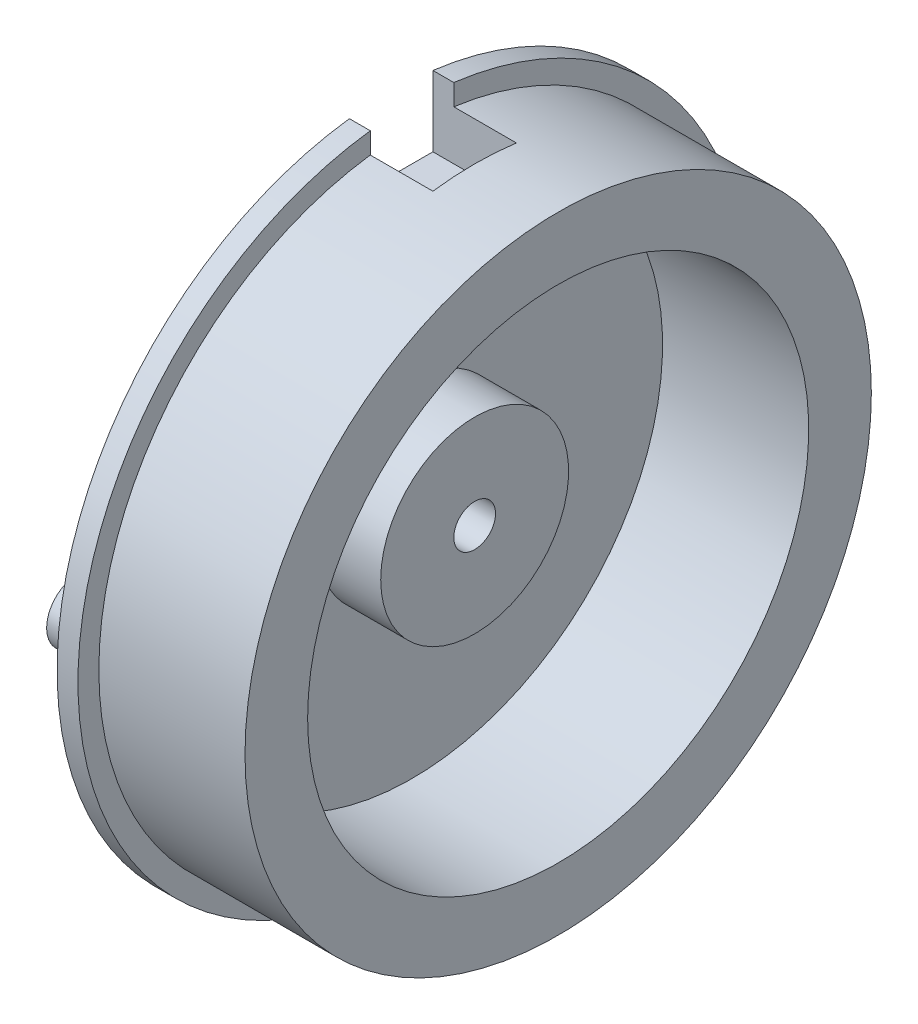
ISO-10303-21;
HEADER;
FILE_DESCRIPTION(('STEP AP214'),'2;1');
FILE_NAME('part.step','',(''),(''),'','','');
FILE_SCHEMA(('AUTOMOTIVE_DESIGN { 1 0 10303 214 1 1 1 1 }'));
ENDSEC;
DATA;
#1=APPLICATION_CONTEXT('core data for automotive mechanical design processes');
#2=APPLICATION_PROTOCOL_DEFINITION('international standard','automotive_design',2000,#1);
#3=PRODUCT_CONTEXT('',#1,'mechanical');
#4=PRODUCT('Part','Part','',(#3));
#5=PRODUCT_RELATED_PRODUCT_CATEGORY('part','',(#4));
#6=PRODUCT_DEFINITION_FORMATION('','',#4);
#7=PRODUCT_DEFINITION_CONTEXT('part definition',#1,'design');
#8=PRODUCT_DEFINITION('design','',#6,#7);
#9=PRODUCT_DEFINITION_SHAPE('','',#8);
#10=(LENGTH_UNIT() NAMED_UNIT(*) SI_UNIT(.MILLI.,.METRE.));
#11=(NAMED_UNIT(*) PLANE_ANGLE_UNIT() SI_UNIT($,.RADIAN.));
#12=(NAMED_UNIT(*) SI_UNIT($,.STERADIAN.) SOLID_ANGLE_UNIT());
#13=UNCERTAINTY_MEASURE_WITH_UNIT(LENGTH_MEASURE(1.E-05),#10,'distance_accuracy_value','');
#14=(GEOMETRIC_REPRESENTATION_CONTEXT(3) GLOBAL_UNCERTAINTY_ASSIGNED_CONTEXT((#13)) GLOBAL_UNIT_ASSIGNED_CONTEXT((#10,
#11,#12)) REPRESENTATION_CONTEXT('',''));
#15=CARTESIAN_POINT('',(0.,0.,0.));
#16=DIRECTION('',(0.,0.,1.));
#17=DIRECTION('',(1.,0.,0.));
#18=AXIS2_PLACEMENT_3D('',#15,#16,#17);
#19=CARTESIAN_POINT('',(0.,4.5,0.));
#20=DIRECTION('',(1.,0.,0.));
#21=DIRECTION('',(0.,0.,-1.));
#22=AXIS2_PLACEMENT_3D('',#19,#20,#21);
#23=PLANE('',#22);
#24=CARTESIAN_POINT('',(0.,0.,13.));
#25=DIRECTION('',(1.,0.,0.));
#26=DIRECTION('',(0.,0.,-1.));
#27=AXIS2_PLACEMENT_3D('',#24,#25,#26);
#28=CIRCLE('',#27,0.999999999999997);
#29=CARTESIAN_POINT('',(0.,0.,12.));
#30=VERTEX_POINT('',#29);
#31=EDGE_CURVE('E35',#30,#30,#28,.F.);
#32=ORIENTED_EDGE('',*,*,#31,.F.);
#33=EDGE_LOOP('',(#32));
#34=FACE_BOUND('',#33,.T.);
#35=DIRECTION('',(0.,0.,-1.));
#36=VECTOR('',#35,1.);
#37=CARTESIAN_POINT('',(0.,-12.5,1.99999999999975));
#38=LINE('',#37,#36);
#39=CARTESIAN_POINT('',(0.,-12.5,1.99999999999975));
#40=VERTEX_POINT('',#39);
#41=CARTESIAN_POINT('',(0.,-12.5,-2.00000000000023));
#42=VERTEX_POINT('',#41);
#43=EDGE_CURVE('E42',#40,#42,#38,.T.);
#44=ORIENTED_EDGE('',*,*,#43,.F.);
#45=DIRECTION('',(0.,1.,0.));
#46=VECTOR('',#45,1.);
#47=CARTESIAN_POINT('',(0.,-15.8745078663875,1.99999999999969));
#48=LINE('',#47,#46);
#49=CARTESIAN_POINT('',(0.,-15.8745078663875,1.99999999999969));
#50=VERTEX_POINT('',#49);
#51=EDGE_CURVE('E124',#50,#40,#48,.T.);
#52=ORIENTED_EDGE('',*,*,#51,.F.);
#53=CARTESIAN_POINT('',(0.,0.,0.));
#54=DIRECTION('',(-1.,0.,0.));
#55=DIRECTION('',(0.,0.,1.));
#56=AXIS2_PLACEMENT_3D('',#53,#54,#55);
#57=CIRCLE('',#56,15.9999999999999);
#58=CARTESIAN_POINT('',(0.,15.8745078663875,1.99999999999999));
#59=VERTEX_POINT('',#58);
#60=EDGE_CURVE('E140',#50,#59,#57,.T.);
#61=ORIENTED_EDGE('',*,*,#60,.T.);
#62=DIRECTION('',(0.,1.,0.));
#63=VECTOR('',#62,1.);
#64=CARTESIAN_POINT('',(0.,12.5,1.99999999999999));
#65=LINE('',#64,#63);
#66=CARTESIAN_POINT('',(0.,12.5,1.99999999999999));
#67=VERTEX_POINT('',#66);
#68=EDGE_CURVE('E264',#67,#59,#65,.T.);
#69=ORIENTED_EDGE('',*,*,#68,.F.);
#70=DIRECTION('',(0.,0.,1.));
#71=VECTOR('',#70,1.);
#72=CARTESIAN_POINT('',(0.,12.5,-1.99999999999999));
#73=LINE('',#72,#71);
#74=CARTESIAN_POINT('',(0.,12.5,-1.99999999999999));
#75=VERTEX_POINT('',#74);
#76=EDGE_CURVE('E50',#75,#67,#73,.T.);
#77=ORIENTED_EDGE('',*,*,#76,.F.);
#78=DIRECTION('',(0.,-1.,0.));
#79=VECTOR('',#78,1.);
#80=CARTESIAN_POINT('',(0.,15.8745078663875,-1.99999999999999));
#81=LINE('',#80,#79);
#82=CARTESIAN_POINT('',(0.,15.8745078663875,-1.99999999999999));
#83=VERTEX_POINT('',#82);
#84=EDGE_CURVE('E138',#83,#75,#81,.T.);
#85=ORIENTED_EDGE('',*,*,#84,.F.);
#86=CARTESIAN_POINT('',(0.,-15.8745078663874,-2.00000000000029));
#87=VERTEX_POINT('',#86);
#88=EDGE_CURVE('E130',#83,#87,#57,.T.);
#89=ORIENTED_EDGE('',*,*,#88,.T.);
#90=DIRECTION('',(0.,-1.,0.));
#91=VECTOR('',#90,1.);
#92=CARTESIAN_POINT('',(0.,-12.5,-2.00000000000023));
#93=LINE('',#92,#91);
#94=EDGE_CURVE('E115',#42,#87,#93,.T.);
#95=ORIENTED_EDGE('',*,*,#94,.F.);
#96=EDGE_LOOP('',(#44,#52,#61,#69,#77,#85,#89,#95));
#97=FACE_BOUND('',#96,.T.);
#98=CARTESIAN_POINT('',(0.,0.,0.));
#99=DIRECTION('',(-1.,0.,0.));
#100=DIRECTION('',(0.,0.,1.));
#101=AXIS2_PLACEMENT_3D('',#98,#99,#100);
#102=CIRCLE('',#101,4.5);
#103=CARTESIAN_POINT('',(0.,0.,4.5));
#104=VERTEX_POINT('',#103);
#105=EDGE_CURVE('E139',#104,#104,#102,.T.);
#106=ORIENTED_EDGE('',*,*,#105,.F.);
#107=EDGE_LOOP('',(#106));
#108=FACE_BOUND('',#107,.T.);
#109=CARTESIAN_POINT('',(0.,11.2583302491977,-6.50000000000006));
#110=DIRECTION('',(1.,0.,0.));
#111=DIRECTION('',(0.,0.,-1.));
#112=AXIS2_PLACEMENT_3D('',#109,#110,#111);
#113=CIRCLE('',#112,0.999999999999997);
#114=CARTESIAN_POINT('',(0.,11.2583302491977,-7.50000000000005));
#115=VERTEX_POINT('',#114);
#116=EDGE_CURVE('E182',#115,#115,#113,.F.);
#117=ORIENTED_EDGE('',*,*,#116,.F.);
#118=EDGE_LOOP('',(#117));
#119=FACE_BOUND('',#118,.T.);
#120=CARTESIAN_POINT('',(0.,-11.2583302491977,-6.50000000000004));
#121=DIRECTION('',(1.,0.,0.));
#122=DIRECTION('',(0.,0.,-1.));
#123=AXIS2_PLACEMENT_3D('',#120,#121,#122);
#124=CIRCLE('',#123,0.999999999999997);
#125=CARTESIAN_POINT('',(0.,-11.2583302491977,-7.50000000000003));
#126=VERTEX_POINT('',#125);
#127=EDGE_CURVE('E11',#126,#126,#124,.F.);
#128=ORIENTED_EDGE('',*,*,#127,.F.);
#129=EDGE_LOOP('',(#128));
#130=FACE_BOUND('',#129,.T.);
#131=ADVANCED_FACE('F27',(#34,#97,#108,#119,#130),#23,.F.);
#132=CARTESIAN_POINT('',(0.,0.,0.));
#133=DIRECTION('',(-1.,0.,0.));
#134=DIRECTION('',(0.,0.,1.));
#135=AXIS2_PLACEMENT_3D('',#132,#133,#134);
#136=CYLINDRICAL_SURFACE('',#135,15.9999999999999);
#137=ORIENTED_EDGE('',*,*,#60,.F.);
#138=DIRECTION('',(-1.,0.,0.));
#139=VECTOR('',#138,1.);
#140=CARTESIAN_POINT('',(4.,-15.8745078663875,1.99999999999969));
#141=LINE('',#140,#139);
#142=CARTESIAN_POINT('',(0.999999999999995,-15.8745078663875,1.99999999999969));
#143=VERTEX_POINT('',#142);
#144=EDGE_CURVE('E133',#143,#50,#141,.T.);
#145=ORIENTED_EDGE('',*,*,#144,.F.);
#146=CARTESIAN_POINT('',(0.999999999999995,0.,0.));
#147=DIRECTION('',(-1.,0.,0.));
#148=DIRECTION('',(0.,0.,1.));
#149=AXIS2_PLACEMENT_3D('',#146,#147,#148);
#150=CIRCLE('',#149,15.9999999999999);
#151=CARTESIAN_POINT('',(0.999999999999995,15.8745078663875,1.99999999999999));
#152=VERTEX_POINT('',#151);
#153=EDGE_CURVE('E176',#143,#152,#150,.T.);
#154=ORIENTED_EDGE('',*,*,#153,.T.);
#155=DIRECTION('',(-1.,0.,0.));
#156=VECTOR('',#155,1.);
#157=CARTESIAN_POINT('',(4.,15.8745078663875,1.99999999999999));
#158=LINE('',#157,#156);
#159=EDGE_CURVE('E258',#152,#59,#158,.T.);
#160=ORIENTED_EDGE('',*,*,#159,.T.);
#161=EDGE_LOOP('',(#137,#145,#154,#160));
#162=FACE_BOUND('',#161,.T.);
#163=ADVANCED_FACE('F190',(#162),#136,.T.);
#164=CARTESIAN_POINT('',(0.999999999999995,15.9999999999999,0.));
#165=DIRECTION('',(-1.,0.,0.));
#166=DIRECTION('',(0.,0.,1.));
#167=AXIS2_PLACEMENT_3D('',#164,#165,#166);
#168=PLANE('',#167);
#169=ORIENTED_EDGE('',*,*,#153,.F.);
#170=DIRECTION('',(0.,1.,0.));
#171=VECTOR('',#170,1.);
#172=CARTESIAN_POINT('',(0.999999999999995,15.9999999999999,2.00000000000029));
#173=LINE('',#172,#171);
#174=CARTESIAN_POINT('',(0.999999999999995,-14.8660687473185,1.99999999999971));
#175=VERTEX_POINT('',#174);
#176=EDGE_CURVE('E250',#143,#175,#173,.T.);
#177=ORIENTED_EDGE('',*,*,#176,.T.);
#178=CARTESIAN_POINT('',(0.999999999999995,0.,0.));
#179=DIRECTION('',(-1.,0.,0.));
#180=DIRECTION('',(0.,0.,1.));
#181=AXIS2_PLACEMENT_3D('',#178,#179,#180);
#182=CIRCLE('',#181,14.9999999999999);
#183=CARTESIAN_POINT('',(0.999999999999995,14.8660687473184,1.99999999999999));
#184=VERTEX_POINT('',#183);
#185=EDGE_CURVE('E172',#175,#184,#182,.T.);
#186=ORIENTED_EDGE('',*,*,#185,.T.);
#187=DIRECTION('',(0.,1.,0.));
#188=VECTOR('',#187,1.);
#189=CARTESIAN_POINT('',(0.999999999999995,15.9999999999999,1.99999999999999));
#190=LINE('',#189,#188);
#191=EDGE_CURVE('E253',#184,#152,#190,.T.);
#192=ORIENTED_EDGE('',*,*,#191,.T.);
#193=EDGE_LOOP('',(#169,#177,#186,#192));
#194=FACE_BOUND('',#193,.T.);
#195=ADVANCED_FACE('F195',(#194),#168,.F.);
#196=CARTESIAN_POINT('',(0.999999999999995,15.8745078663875,-1.99999999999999));
#197=VERTEX_POINT('',#196);
#198=CARTESIAN_POINT('',(0.999999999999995,-15.8745078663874,-2.00000000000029));
#199=VERTEX_POINT('',#198);
#200=EDGE_CURVE('E132',#197,#199,#150,.T.);
#201=ORIENTED_EDGE('',*,*,#200,.T.);
#202=DIRECTION('',(-1.,0.,0.));
#203=VECTOR('',#202,1.);
#204=CARTESIAN_POINT('',(4.,-15.8745078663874,-2.00000000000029));
#205=LINE('',#204,#203);
#206=EDGE_CURVE('E118',#199,#87,#205,.T.);
#207=ORIENTED_EDGE('',*,*,#206,.T.);
#208=ORIENTED_EDGE('',*,*,#88,.F.);
#209=DIRECTION('',(-1.,0.,0.));
#210=VECTOR('',#209,1.);
#211=CARTESIAN_POINT('',(4.,15.8745078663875,-1.99999999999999));
#212=LINE('',#211,#210);
#213=EDGE_CURVE('E265',#197,#83,#212,.T.);
#214=ORIENTED_EDGE('',*,*,#213,.F.);
#215=EDGE_LOOP('',(#201,#207,#208,#214));
#216=FACE_BOUND('',#215,.T.);
#217=ADVANCED_FACE('F29',(#216),#136,.T.);
#218=CARTESIAN_POINT('',(0.999999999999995,14.8660687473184,-1.99999999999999));
#219=VERTEX_POINT('',#218);
#220=CARTESIAN_POINT('',(0.999999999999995,-14.8660687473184,-2.00000000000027));
#221=VERTEX_POINT('',#220);
#222=EDGE_CURVE('E173',#219,#221,#182,.T.);
#223=ORIENTED_EDGE('',*,*,#222,.T.);
#224=DIRECTION('',(0.,-1.,0.));
#225=VECTOR('',#224,1.);
#226=CARTESIAN_POINT('',(0.999999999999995,16.,-1.99999999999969));
#227=LINE('',#226,#225);
#228=EDGE_CURVE('E288',#221,#199,#227,.T.);
#229=ORIENTED_EDGE('',*,*,#228,.T.);
#230=ORIENTED_EDGE('',*,*,#200,.F.);
#231=DIRECTION('',(0.,-1.,0.));
#232=VECTOR('',#231,1.);
#233=CARTESIAN_POINT('',(0.999999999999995,15.9999999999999,-1.99999999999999));
#234=LINE('',#233,#232);
#235=EDGE_CURVE('E145',#197,#219,#234,.T.);
#236=ORIENTED_EDGE('',*,*,#235,.T.);
#237=EDGE_LOOP('',(#223,#229,#230,#236));
#238=FACE_BOUND('',#237,.T.);
#239=ADVANCED_FACE('F236',(#238),#168,.F.);
#240=CARTESIAN_POINT('',(0.,0.,0.));
#241=DIRECTION('',(-1.,0.,0.));
#242=DIRECTION('',(0.,0.,1.));
#243=AXIS2_PLACEMENT_3D('',#240,#241,#242);
#244=CYLINDRICAL_SURFACE('',#243,14.9999999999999);
#245=ORIENTED_EDGE('',*,*,#185,.F.);
#246=DIRECTION('',(-1.,0.,0.));
#247=VECTOR('',#246,1.);
#248=CARTESIAN_POINT('',(0.,-14.8660687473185,1.99999999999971));
#249=LINE('',#248,#247);
#250=CARTESIAN_POINT('',(4.,-14.8660687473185,1.99999999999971));
#251=VERTEX_POINT('',#250);
#252=EDGE_CURVE('E291',#175,#251,#249,.F.);
#253=ORIENTED_EDGE('',*,*,#252,.T.);
#254=CARTESIAN_POINT('',(4.,0.,0.));
#255=DIRECTION('',(-1.,0.,0.));
#256=DIRECTION('',(0.,0.,1.));
#257=AXIS2_PLACEMENT_3D('',#254,#255,#256);
#258=CIRCLE('',#257,14.9999999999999);
#259=CARTESIAN_POINT('',(4.,-14.8660687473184,-2.00000000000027));
#260=VERTEX_POINT('',#259);
#261=EDGE_CURVE('E180',#260,#251,#258,.T.);
#262=ORIENTED_EDGE('',*,*,#261,.F.);
#263=DIRECTION('',(-1.,0.,0.));
#264=VECTOR('',#263,1.);
#265=CARTESIAN_POINT('',(0.,-14.8660687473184,-2.00000000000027));
#266=LINE('',#265,#264);
#267=EDGE_CURVE('E285',#260,#221,#266,.T.);
#268=ORIENTED_EDGE('',*,*,#267,.T.);
#269=ORIENTED_EDGE('',*,*,#222,.F.);
#270=DIRECTION('',(-1.,0.,0.));
#271=VECTOR('',#270,1.);
#272=CARTESIAN_POINT('',(0.,14.8660687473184,-1.99999999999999));
#273=LINE('',#272,#271);
#274=CARTESIAN_POINT('',(4.,14.8660687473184,-1.99999999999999));
#275=VERTEX_POINT('',#274);
#276=EDGE_CURVE('E276',#219,#275,#273,.F.);
#277=ORIENTED_EDGE('',*,*,#276,.T.);
#278=CARTESIAN_POINT('',(4.,0.,0.));
#279=DIRECTION('',(-1.,0.,0.));
#280=DIRECTION('',(0.,0.,1.));
#281=AXIS2_PLACEMENT_3D('',#278,#279,#280);
#282=CIRCLE('',#281,14.9999999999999);
#283=CARTESIAN_POINT('',(4.,14.8660687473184,1.99999999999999));
#284=VERTEX_POINT('',#283);
#285=EDGE_CURVE('E178',#284,#275,#282,.T.);
#286=ORIENTED_EDGE('',*,*,#285,.F.);
#287=DIRECTION('',(-1.,0.,0.));
#288=VECTOR('',#287,1.);
#289=CARTESIAN_POINT('',(0.,14.8660687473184,1.99999999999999));
#290=LINE('',#289,#288);
#291=EDGE_CURVE('E274',#284,#184,#290,.T.);
#292=ORIENTED_EDGE('',*,*,#291,.T.);
#293=EDGE_LOOP('',(#245,#253,#262,#268,#269,#277,#286,#292));
#294=FACE_BOUND('',#293,.T.);
#295=CARTESIAN_POINT('',(7.99999999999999,0.,0.));
#296=DIRECTION('',(-1.,0.,0.));
#297=DIRECTION('',(0.,0.,1.));
#298=AXIS2_PLACEMENT_3D('',#295,#296,#297);
#299=CIRCLE('',#298,14.9999999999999);
#300=CARTESIAN_POINT('',(7.99999999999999,0.,14.9999999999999));
#301=VERTEX_POINT('',#300);
#302=EDGE_CURVE('E169',#301,#301,#299,.T.);
#303=ORIENTED_EDGE('',*,*,#302,.T.);
#304=EDGE_LOOP('',(#303));
#305=FACE_BOUND('',#304,.T.);
#306=ADVANCED_FACE('F233',(#294,#305),#244,.T.);
#307=CARTESIAN_POINT('',(7.99999999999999,14.9999999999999,0.));
#308=DIRECTION('',(-1.,0.,0.));
#309=DIRECTION('',(0.,0.,1.));
#310=AXIS2_PLACEMENT_3D('',#307,#308,#309);
#311=PLANE('',#310);
#312=ORIENTED_EDGE('',*,*,#302,.F.);
#313=EDGE_LOOP('',(#312));
#314=FACE_BOUND('',#313,.T.);
#315=CARTESIAN_POINT('',(7.99999999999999,0.,0.));
#316=DIRECTION('',(-1.,0.,0.));
#317=DIRECTION('',(0.,0.,1.));
#318=AXIS2_PLACEMENT_3D('',#315,#316,#317);
#319=CIRCLE('',#318,11.9999999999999);
#320=CARTESIAN_POINT('',(7.99999999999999,0.,11.9999999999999));
#321=VERTEX_POINT('',#320);
#322=EDGE_CURVE('E166',#321,#321,#319,.T.);
#323=ORIENTED_EDGE('',*,*,#322,.T.);
#324=EDGE_LOOP('',(#323));
#325=FACE_BOUND('',#324,.T.);
#326=ADVANCED_FACE('F229',(#314,#325),#311,.F.);
#327=CARTESIAN_POINT('',(0.,0.,0.));
#328=DIRECTION('',(-1.,0.,0.));
#329=DIRECTION('',(0.,0.,1.));
#330=AXIS2_PLACEMENT_3D('',#327,#328,#329);
#331=CYLINDRICAL_SURFACE('',#330,11.9999999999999);
#332=ORIENTED_EDGE('',*,*,#322,.F.);
#333=EDGE_LOOP('',(#332));
#334=FACE_BOUND('',#333,.T.);
#335=CARTESIAN_POINT('',(0.999999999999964,0.,0.));
#336=DIRECTION('',(-1.,0.,0.));
#337=DIRECTION('',(0.,0.,1.));
#338=AXIS2_PLACEMENT_3D('',#335,#336,#337);
#339=CIRCLE('',#338,11.9999999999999);
#340=CARTESIAN_POINT('',(0.999999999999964,0.,11.9999999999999));
#341=VERTEX_POINT('',#340);
#342=EDGE_CURVE('E163',#341,#341,#339,.T.);
#343=ORIENTED_EDGE('',*,*,#342,.T.);
#344=EDGE_LOOP('',(#343));
#345=FACE_BOUND('',#344,.T.);
#346=ADVANCED_FACE('F225',(#334,#345),#331,.F.);
#347=CARTESIAN_POINT('',(0.999999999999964,11.9999999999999,0.));
#348=DIRECTION('',(-1.,0.,0.));
#349=DIRECTION('',(0.,0.,1.));
#350=AXIS2_PLACEMENT_3D('',#347,#348,#349);
#351=PLANE('',#350);
#352=ORIENTED_EDGE('',*,*,#342,.F.);
#353=EDGE_LOOP('',(#352));
#354=FACE_BOUND('',#353,.T.);
#355=CARTESIAN_POINT('',(0.999999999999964,0.,0.));
#356=DIRECTION('',(-1.,0.,0.));
#357=DIRECTION('',(0.,0.,1.));
#358=AXIS2_PLACEMENT_3D('',#355,#356,#357);
#359=CIRCLE('',#358,4.5);
#360=CARTESIAN_POINT('',(0.999999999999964,0.,4.5));
#361=VERTEX_POINT('',#360);
#362=EDGE_CURVE('E160',#361,#361,#359,.T.);
#363=ORIENTED_EDGE('',*,*,#362,.T.);
#364=EDGE_LOOP('',(#363));
#365=FACE_BOUND('',#364,.T.);
#366=ADVANCED_FACE('F221',(#354,#365),#351,.F.);
#367=CARTESIAN_POINT('',(0.,0.,0.));
#368=DIRECTION('',(-1.,0.,0.));
#369=DIRECTION('',(0.,0.,1.));
#370=AXIS2_PLACEMENT_3D('',#367,#368,#369);
#371=CYLINDRICAL_SURFACE('',#370,4.5);
#372=ORIENTED_EDGE('',*,*,#362,.F.);
#373=EDGE_LOOP('',(#372));
#374=FACE_BOUND('',#373,.T.);
#375=CARTESIAN_POINT('',(3.99999999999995,0.,0.));
#376=DIRECTION('',(-1.,0.,0.));
#377=DIRECTION('',(0.,0.,1.));
#378=AXIS2_PLACEMENT_3D('',#375,#376,#377);
#379=CIRCLE('',#378,4.5);
#380=CARTESIAN_POINT('',(3.99999999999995,0.,4.5));
#381=VERTEX_POINT('',#380);
#382=EDGE_CURVE('E157',#381,#381,#379,.T.);
#383=ORIENTED_EDGE('',*,*,#382,.T.);
#384=EDGE_LOOP('',(#383));
#385=FACE_BOUND('',#384,.T.);
#386=ADVANCED_FACE('F217',(#374,#385),#371,.T.);
#387=CARTESIAN_POINT('',(3.99999999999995,4.5,0.));
#388=DIRECTION('',(-1.,0.,0.));
#389=DIRECTION('',(0.,0.,1.));
#390=AXIS2_PLACEMENT_3D('',#387,#388,#389);
#391=PLANE('',#390);
#392=ORIENTED_EDGE('',*,*,#382,.F.);
#393=EDGE_LOOP('',(#392));
#394=FACE_BOUND('',#393,.T.);
#395=CARTESIAN_POINT('',(3.99999999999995,0.,0.));
#396=DIRECTION('',(-1.,0.,0.));
#397=DIRECTION('',(0.,0.,1.));
#398=AXIS2_PLACEMENT_3D('',#395,#396,#397);
#399=CIRCLE('',#398,0.99999999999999);
#400=CARTESIAN_POINT('',(3.99999999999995,0.,0.99999999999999));
#401=VERTEX_POINT('',#400);
#402=EDGE_CURVE('E154',#401,#401,#399,.T.);
#403=ORIENTED_EDGE('',*,*,#402,.T.);
#404=EDGE_LOOP('',(#403));
#405=FACE_BOUND('',#404,.T.);
#406=ADVANCED_FACE('F213',(#394,#405),#391,.F.);
#407=CARTESIAN_POINT('',(0.,0.,0.));
#408=DIRECTION('',(-1.,0.,0.));
#409=DIRECTION('',(0.,0.,1.));
#410=AXIS2_PLACEMENT_3D('',#407,#408,#409);
#411=CYLINDRICAL_SURFACE('',#410,0.999999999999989);
#412=ORIENTED_EDGE('',*,*,#402,.F.);
#413=EDGE_LOOP('',(#412));
#414=FACE_BOUND('',#413,.T.);
#415=CARTESIAN_POINT('',(-1.5,0.,0.));
#416=DIRECTION('',(-1.,0.,0.));
#417=DIRECTION('',(0.,0.,1.));
#418=AXIS2_PLACEMENT_3D('',#415,#416,#417);
#419=CIRCLE('',#418,0.999999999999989);
#420=CARTESIAN_POINT('',(-1.5,0.,0.999999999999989));
#421=VERTEX_POINT('',#420);
#422=EDGE_CURVE('E151',#421,#421,#419,.T.);
#423=ORIENTED_EDGE('',*,*,#422,.T.);
#424=EDGE_LOOP('',(#423));
#425=FACE_BOUND('',#424,.T.);
#426=ADVANCED_FACE('F209',(#414,#425),#411,.F.);
#427=CARTESIAN_POINT('',(-1.5,0.999999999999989,0.));
#428=DIRECTION('',(1.,0.,0.));
#429=DIRECTION('',(0.,0.,-1.));
#430=AXIS2_PLACEMENT_3D('',#427,#428,#429);
#431=PLANE('',#430);
#432=ORIENTED_EDGE('',*,*,#422,.F.);
#433=EDGE_LOOP('',(#432));
#434=FACE_BOUND('',#433,.T.);
#435=CARTESIAN_POINT('',(-1.5,0.,0.));
#436=DIRECTION('',(-1.,0.,0.));
#437=DIRECTION('',(0.,0.,1.));
#438=AXIS2_PLACEMENT_3D('',#435,#436,#437);
#439=CIRCLE('',#438,4.5);
#440=CARTESIAN_POINT('',(-1.5,0.,4.5));
#441=VERTEX_POINT('',#440);
#442=EDGE_CURVE('E143',#441,#441,#439,.T.);
#443=ORIENTED_EDGE('',*,*,#442,.T.);
#444=EDGE_LOOP('',(#443));
#445=FACE_BOUND('',#444,.T.);
#446=ADVANCED_FACE('F205',(#434,#445),#431,.F.);
#447=CARTESIAN_POINT('',(0.,0.,0.));
#448=DIRECTION('',(-1.,0.,0.));
#449=DIRECTION('',(0.,0.,1.));
#450=AXIS2_PLACEMENT_3D('',#447,#448,#449);
#451=CYLINDRICAL_SURFACE('',#450,4.5);
#452=ORIENTED_EDGE('',*,*,#442,.F.);
#453=EDGE_LOOP('',(#452));
#454=FACE_BOUND('',#453,.T.);
#455=ORIENTED_EDGE('',*,*,#105,.T.);
#456=EDGE_LOOP('',(#455));
#457=FACE_BOUND('',#456,.T.);
#458=ADVANCED_FACE('F201',(#454,#457),#451,.T.);
#459=CARTESIAN_POINT('',(4.,0.,0.));
#460=DIRECTION('',(-1.,0.,0.));
#461=DIRECTION('',(0.,0.,1.));
#462=AXIS2_PLACEMENT_3D('',#459,#460,#461);
#463=PLANE('',#462);
#464=ORIENTED_EDGE('',*,*,#285,.T.);
#465=DIRECTION('',(0.,-1.,0.));
#466=VECTOR('',#465,1.);
#467=CARTESIAN_POINT('',(4.,15.8745078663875,-1.99999999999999));
#468=LINE('',#467,#466);
#469=CARTESIAN_POINT('',(4.,12.5,-1.99999999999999));
#470=VERTEX_POINT('',#469);
#471=EDGE_CURVE('E270',#275,#470,#468,.T.);
#472=ORIENTED_EDGE('',*,*,#471,.T.);
#473=DIRECTION('',(0.,0.,1.));
#474=VECTOR('',#473,1.);
#475=CARTESIAN_POINT('',(4.,12.5,-1.99999999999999));
#476=LINE('',#475,#474);
#477=CARTESIAN_POINT('',(4.,12.5,1.99999999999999));
#478=VERTEX_POINT('',#477);
#479=EDGE_CURVE('E301',#470,#478,#476,.T.);
#480=ORIENTED_EDGE('',*,*,#479,.T.);
#481=DIRECTION('',(0.,1.,0.));
#482=VECTOR('',#481,1.);
#483=CARTESIAN_POINT('',(4.,12.5,1.99999999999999));
#484=LINE('',#483,#482);
#485=EDGE_CURVE('E304',#478,#284,#484,.T.);
#486=ORIENTED_EDGE('',*,*,#485,.T.);
#487=EDGE_LOOP('',(#464,#472,#480,#486));
#488=FACE_BOUND('',#487,.T.);
#489=ADVANCED_FACE('F204',(#488),#463,.T.);
#490=CARTESIAN_POINT('',(4.,15.8745078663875,-1.99999999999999));
#491=DIRECTION('',(0.,0.,-1.));
#492=DIRECTION('',(0.,1.,0.));
#493=AXIS2_PLACEMENT_3D('',#490,#491,#492);
#494=PLANE('',#493);
#495=ORIENTED_EDGE('',*,*,#213,.T.);
#496=ORIENTED_EDGE('',*,*,#84,.T.);
#497=DIRECTION('',(-1.,0.,0.));
#498=VECTOR('',#497,1.);
#499=CARTESIAN_POINT('',(4.,12.5,-1.99999999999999));
#500=LINE('',#499,#498);
#501=EDGE_CURVE('E268',#470,#75,#500,.T.);
#502=ORIENTED_EDGE('',*,*,#501,.F.);
#503=ORIENTED_EDGE('',*,*,#471,.F.);
#504=ORIENTED_EDGE('',*,*,#276,.F.);
#505=ORIENTED_EDGE('',*,*,#235,.F.);
#506=EDGE_LOOP('',(#495,#496,#502,#503,#504,#505));
#507=FACE_BOUND('',#506,.T.);
#508=ADVANCED_FACE('F310',(#507),#494,.F.);
#509=CARTESIAN_POINT('',(4.,12.5,1.99999999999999));
#510=DIRECTION('',(0.,0.,1.));
#511=DIRECTION('',(1.,0.,0.));
#512=AXIS2_PLACEMENT_3D('',#509,#510,#511);
#513=PLANE('',#512);
#514=ORIENTED_EDGE('',*,*,#291,.F.);
#515=ORIENTED_EDGE('',*,*,#485,.F.);
#516=DIRECTION('',(-1.,0.,0.));
#517=VECTOR('',#516,1.);
#518=CARTESIAN_POINT('',(4.,12.5,1.99999999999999));
#519=LINE('',#518,#517);
#520=EDGE_CURVE('E266',#478,#67,#519,.T.);
#521=ORIENTED_EDGE('',*,*,#520,.T.);
#522=ORIENTED_EDGE('',*,*,#68,.T.);
#523=ORIENTED_EDGE('',*,*,#159,.F.);
#524=ORIENTED_EDGE('',*,*,#191,.F.);
#525=EDGE_LOOP('',(#514,#515,#521,#522,#523,#524));
#526=FACE_BOUND('',#525,.T.);
#527=ADVANCED_FACE('F261',(#526),#513,.F.);
#528=CARTESIAN_POINT('',(4.,12.5,-1.99999999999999));
#529=DIRECTION('',(0.,-1.,0.));
#530=DIRECTION('',(0.,0.,-1.));
#531=AXIS2_PLACEMENT_3D('',#528,#529,#530);
#532=PLANE('',#531);
#533=ORIENTED_EDGE('',*,*,#76,.T.);
#534=ORIENTED_EDGE('',*,*,#520,.F.);
#535=ORIENTED_EDGE('',*,*,#479,.F.);
#536=ORIENTED_EDGE('',*,*,#501,.T.);
#537=EDGE_LOOP('',(#533,#534,#535,#536));
#538=FACE_BOUND('',#537,.T.);
#539=ADVANCED_FACE('F199',(#538),#532,.F.);
#540=CARTESIAN_POINT('',(4.,0.,0.));
#541=DIRECTION('',(-1.,0.,0.));
#542=DIRECTION('',(0.,0.,-1.));
#543=AXIS2_PLACEMENT_3D('',#540,#541,#542);
#544=PLANE('',#543);
#545=ORIENTED_EDGE('',*,*,#261,.T.);
#546=DIRECTION('',(0.,1.,0.));
#547=VECTOR('',#546,1.);
#548=CARTESIAN_POINT('',(4.,-15.8745078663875,1.99999999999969));
#549=LINE('',#548,#547);
#550=CARTESIAN_POINT('',(4.,-12.5,1.99999999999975));
#551=VERTEX_POINT('',#550);
#552=EDGE_CURVE('E323',#251,#551,#549,.T.);
#553=ORIENTED_EDGE('',*,*,#552,.T.);
#554=DIRECTION('',(0.,0.,-1.));
#555=VECTOR('',#554,1.);
#556=CARTESIAN_POINT('',(4.,-12.5,1.99999999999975));
#557=LINE('',#556,#555);
#558=CARTESIAN_POINT('',(4.,-12.5,-2.00000000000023));
#559=VERTEX_POINT('',#558);
#560=EDGE_CURVE('E315',#551,#559,#557,.T.);
#561=ORIENTED_EDGE('',*,*,#560,.T.);
#562=DIRECTION('',(0.,-1.,0.));
#563=VECTOR('',#562,1.);
#564=CARTESIAN_POINT('',(4.,-12.5,-2.00000000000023));
#565=LINE('',#564,#563);
#566=EDGE_CURVE('E318',#559,#260,#565,.T.);
#567=ORIENTED_EDGE('',*,*,#566,.T.);
#568=EDGE_LOOP('',(#545,#553,#561,#567));
#569=FACE_BOUND('',#568,.T.);
#570=ADVANCED_FACE('F342',(#569),#544,.T.);
#571=CARTESIAN_POINT('',(4.,-15.8745078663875,1.99999999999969));
#572=DIRECTION('',(0.,0.,1.));
#573=DIRECTION('',(0.,-1.,0.));
#574=AXIS2_PLACEMENT_3D('',#571,#572,#573);
#575=PLANE('',#574);
#576=ORIENTED_EDGE('',*,*,#144,.T.);
#577=ORIENTED_EDGE('',*,*,#51,.T.);
#578=DIRECTION('',(-1.,0.,0.));
#579=VECTOR('',#578,1.);
#580=CARTESIAN_POINT('',(4.,-12.5,1.99999999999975));
#581=LINE('',#580,#579);
#582=EDGE_CURVE('E289',#551,#40,#581,.T.);
#583=ORIENTED_EDGE('',*,*,#582,.F.);
#584=ORIENTED_EDGE('',*,*,#552,.F.);
#585=ORIENTED_EDGE('',*,*,#252,.F.);
#586=ORIENTED_EDGE('',*,*,#176,.F.);
#587=EDGE_LOOP('',(#576,#577,#583,#584,#585,#586));
#588=FACE_BOUND('',#587,.T.);
#589=ADVANCED_FACE('F325',(#588),#575,.F.);
#590=CARTESIAN_POINT('',(4.,-12.5,-2.00000000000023));
#591=DIRECTION('',(0.,0.,-1.));
#592=DIRECTION('',(0.,1.,0.));
#593=AXIS2_PLACEMENT_3D('',#590,#591,#592);
#594=PLANE('',#593);
#595=ORIENTED_EDGE('',*,*,#267,.F.);
#596=ORIENTED_EDGE('',*,*,#566,.F.);
#597=DIRECTION('',(-1.,0.,0.));
#598=VECTOR('',#597,1.);
#599=CARTESIAN_POINT('',(4.,-12.5,-2.00000000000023));
#600=LINE('',#599,#598);
#601=EDGE_CURVE('E121',#559,#42,#600,.T.);
#602=ORIENTED_EDGE('',*,*,#601,.T.);
#603=ORIENTED_EDGE('',*,*,#94,.T.);
#604=ORIENTED_EDGE('',*,*,#206,.F.);
#605=ORIENTED_EDGE('',*,*,#228,.F.);
#606=EDGE_LOOP('',(#595,#596,#602,#603,#604,#605));
#607=FACE_BOUND('',#606,.T.);
#608=ADVANCED_FACE('F117',(#607),#594,.F.);
#609=CARTESIAN_POINT('',(4.,-12.5,1.99999999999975));
#610=DIRECTION('',(0.,1.,0.));
#611=DIRECTION('',(0.,0.,1.));
#612=AXIS2_PLACEMENT_3D('',#609,#610,#611);
#613=PLANE('',#612);
#614=ORIENTED_EDGE('',*,*,#43,.T.);
#615=ORIENTED_EDGE('',*,*,#601,.F.);
#616=ORIENTED_EDGE('',*,*,#560,.F.);
#617=ORIENTED_EDGE('',*,*,#582,.T.);
#618=EDGE_LOOP('',(#614,#615,#616,#617));
#619=FACE_BOUND('',#618,.T.);
#620=ADVANCED_FACE('F336',(#619),#613,.F.);
#621=CARTESIAN_POINT('',(-1.,11.2583302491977,-6.50000000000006));
#622=DIRECTION('',(1.,0.,0.));
#623=DIRECTION('',(0.,0.,-1.));
#624=AXIS2_PLACEMENT_3D('',#621,#622,#623);
#625=CYLINDRICAL_SURFACE('',#624,0.999999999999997);
#626=CARTESIAN_POINT('',(-1.,11.2583302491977,-6.50000000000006));
#627=DIRECTION('',(-1.,0.,0.));
#628=DIRECTION('',(0.,0.,1.));
#629=AXIS2_PLACEMENT_3D('',#626,#627,#628);
#630=CIRCLE('',#629,0.999999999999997);
#631=CARTESIAN_POINT('',(-1.,11.2583302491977,-5.50000000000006));
#632=VERTEX_POINT('',#631);
#633=EDGE_CURVE('E373',#632,#632,#630,.T.);
#634=ORIENTED_EDGE('',*,*,#633,.F.);
#635=EDGE_LOOP('',(#634));
#636=FACE_BOUND('',#635,.T.);
#637=ORIENTED_EDGE('',*,*,#116,.T.);
#638=EDGE_LOOP('',(#637));
#639=FACE_BOUND('',#638,.T.);
#640=ADVANCED_FACE('F353',(#636,#639),#625,.T.);
#641=CARTESIAN_POINT('',(-1.,11.2583302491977,-6.50000000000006));
#642=DIRECTION('',(-1.,0.,0.));
#643=DIRECTION('',(0.,0.,1.));
#644=AXIS2_PLACEMENT_3D('',#641,#642,#643);
#645=PLANE('',#644);
#646=CARTESIAN_POINT('',(-1.,11.2583302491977,-6.50000000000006));
#647=DIRECTION('',(-1.,0.,0.));
#648=DIRECTION('',(0.,0.,1.));
#649=AXIS2_PLACEMENT_3D('',#646,#647,#648);
#650=CIRCLE('',#649,1.5);
#651=CARTESIAN_POINT('',(-1.,11.2583302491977,-5.00000000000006));
#652=VERTEX_POINT('',#651);
#653=EDGE_CURVE('E410',#652,#652,#650,.T.);
#654=ORIENTED_EDGE('',*,*,#653,.F.);
#655=EDGE_LOOP('',(#654));
#656=FACE_BOUND('',#655,.T.);
#657=ORIENTED_EDGE('',*,*,#633,.T.);
#658=EDGE_LOOP('',(#657));
#659=FACE_BOUND('',#658,.T.);
#660=ADVANCED_FACE('F362',(#656,#659),#645,.F.);
#661=CARTESIAN_POINT('',(-2.,11.2583302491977,-6.50000000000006));
#662=DIRECTION('',(1.,0.,0.));
#663=DIRECTION('',(0.,0.,-1.));
#664=AXIS2_PLACEMENT_3D('',#661,#662,#663);
#665=CYLINDRICAL_SURFACE('',#664,1.5);
#666=CARTESIAN_POINT('',(-2.,11.2583302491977,-6.50000000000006));
#667=DIRECTION('',(-1.,0.,0.));
#668=DIRECTION('',(0.,0.,1.));
#669=AXIS2_PLACEMENT_3D('',#666,#667,#668);
#670=CIRCLE('',#669,1.5);
#671=CARTESIAN_POINT('',(-2.,11.2583302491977,-5.00000000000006));
#672=VERTEX_POINT('',#671);
#673=EDGE_CURVE('E407',#672,#672,#670,.T.);
#674=ORIENTED_EDGE('',*,*,#673,.F.);
#675=EDGE_LOOP('',(#674));
#676=FACE_BOUND('',#675,.T.);
#677=ORIENTED_EDGE('',*,*,#653,.T.);
#678=EDGE_LOOP('',(#677));
#679=FACE_BOUND('',#678,.T.);
#680=ADVANCED_FACE('F367',(#676,#679),#665,.T.);
#681=CARTESIAN_POINT('',(-2.,11.2583302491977,-6.50000000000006));
#682=DIRECTION('',(-1.,0.,0.));
#683=DIRECTION('',(0.,0.,1.));
#684=AXIS2_PLACEMENT_3D('',#681,#682,#683);
#685=PLANE('',#684);
#686=ORIENTED_EDGE('',*,*,#673,.T.);
#687=EDGE_LOOP('',(#686));
#688=FACE_BOUND('',#687,.T.);
#689=ADVANCED_FACE('F391',(#688),#685,.T.);
#690=CARTESIAN_POINT('',(-1.,0.,13.));
#691=DIRECTION('',(1.,0.,0.));
#692=DIRECTION('',(0.,0.,-1.));
#693=AXIS2_PLACEMENT_3D('',#690,#691,#692);
#694=CYLINDRICAL_SURFACE('',#693,0.999999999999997);
#695=CARTESIAN_POINT('',(-1.,0.,13.));
#696=DIRECTION('',(-1.,0.,0.));
#697=DIRECTION('',(0.,-0.866025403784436,-0.500000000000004));
#698=AXIS2_PLACEMENT_3D('',#695,#696,#697);
#699=CIRCLE('',#698,0.999999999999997);
#700=CARTESIAN_POINT('',(-1.,-0.866025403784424,12.5));
#701=VERTEX_POINT('',#700);
#702=EDGE_CURVE('E411',#701,#701,#699,.T.);
#703=ORIENTED_EDGE('',*,*,#702,.F.);
#704=EDGE_LOOP('',(#703));
#705=FACE_BOUND('',#704,.T.);
#706=ORIENTED_EDGE('',*,*,#31,.T.);
#707=EDGE_LOOP('',(#706));
#708=FACE_BOUND('',#707,.T.);
#709=ADVANCED_FACE('F187',(#705,#708),#694,.T.);
#710=CARTESIAN_POINT('',(-1.,-11.2583302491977,-6.50000000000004));
#711=DIRECTION('',(1.,0.,0.));
#712=DIRECTION('',(0.,0.,-1.));
#713=AXIS2_PLACEMENT_3D('',#710,#711,#712);
#714=CYLINDRICAL_SURFACE('',#713,0.999999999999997);
#715=CARTESIAN_POINT('',(-1.,-11.2583302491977,-6.50000000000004));
#716=DIRECTION('',(-1.,0.,0.));
#717=DIRECTION('',(0.,0.866025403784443,-0.499999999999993));
#718=AXIS2_PLACEMENT_3D('',#715,#716,#717);
#719=CIRCLE('',#718,0.999999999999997);
#720=CARTESIAN_POINT('',(-1.,-10.3923048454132,-7.00000000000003));
#721=VERTEX_POINT('',#720);
#722=EDGE_CURVE('E415',#721,#721,#719,.T.);
#723=ORIENTED_EDGE('',*,*,#722,.F.);
#724=EDGE_LOOP('',(#723));
#725=FACE_BOUND('',#724,.T.);
#726=ORIENTED_EDGE('',*,*,#127,.T.);
#727=EDGE_LOOP('',(#726));
#728=FACE_BOUND('',#727,.T.);
#729=ADVANCED_FACE('F379',(#725,#728),#714,.T.);
#730=CARTESIAN_POINT('',(-1.,0.,13.));
#731=DIRECTION('',(-1.,0.,0.));
#732=DIRECTION('',(0.,-0.866025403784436,-0.500000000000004));
#733=AXIS2_PLACEMENT_3D('',#730,#731,#732);
#734=PLANE('',#733);
#735=CARTESIAN_POINT('',(-1.,0.,13.));
#736=DIRECTION('',(-1.,0.,0.));
#737=DIRECTION('',(0.,-0.866025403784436,-0.500000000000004));
#738=AXIS2_PLACEMENT_3D('',#735,#736,#737);
#739=CIRCLE('',#738,1.5);
#740=CARTESIAN_POINT('',(-1.,-1.29903810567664,12.25));
#741=VERTEX_POINT('',#740);
#742=EDGE_CURVE('E425',#741,#741,#739,.T.);
#743=ORIENTED_EDGE('',*,*,#742,.F.);
#744=EDGE_LOOP('',(#743));
#745=FACE_BOUND('',#744,.T.);
#746=ORIENTED_EDGE('',*,*,#702,.T.);
#747=EDGE_LOOP('',(#746));
#748=FACE_BOUND('',#747,.T.);
#749=ADVANCED_FACE('F381',(#745,#748),#734,.F.);
#750=CARTESIAN_POINT('',(-2.,0.,13.));
#751=DIRECTION('',(1.,0.,0.));
#752=DIRECTION('',(0.,0.,-1.));
#753=AXIS2_PLACEMENT_3D('',#750,#751,#752);
#754=CYLINDRICAL_SURFACE('',#753,1.5);
#755=CARTESIAN_POINT('',(-2.,0.,13.));
#756=DIRECTION('',(-1.,0.,0.));
#757=DIRECTION('',(0.,-0.866025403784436,-0.500000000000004));
#758=AXIS2_PLACEMENT_3D('',#755,#756,#757);
#759=CIRCLE('',#758,1.5);
#760=CARTESIAN_POINT('',(-2.,-1.29903810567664,12.25));
#761=VERTEX_POINT('',#760);
#762=EDGE_CURVE('E422',#761,#761,#759,.T.);
#763=ORIENTED_EDGE('',*,*,#762,.F.);
#764=EDGE_LOOP('',(#763));
#765=FACE_BOUND('',#764,.T.);
#766=ORIENTED_EDGE('',*,*,#742,.T.);
#767=EDGE_LOOP('',(#766));
#768=FACE_BOUND('',#767,.T.);
#769=ADVANCED_FACE('F388',(#765,#768),#754,.T.);
#770=CARTESIAN_POINT('',(-2.,0.,13.));
#771=DIRECTION('',(-1.,0.,0.));
#772=DIRECTION('',(0.,-0.866025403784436,-0.500000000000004));
#773=AXIS2_PLACEMENT_3D('',#770,#771,#772);
#774=PLANE('',#773);
#775=ORIENTED_EDGE('',*,*,#762,.T.);
#776=EDGE_LOOP('',(#775));
#777=FACE_BOUND('',#776,.T.);
#778=ADVANCED_FACE('F440',(#777),#774,.T.);
#779=CARTESIAN_POINT('',(-1.,-11.2583302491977,-6.50000000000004));
#780=DIRECTION('',(-1.,0.,0.));
#781=DIRECTION('',(0.,0.866025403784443,-0.499999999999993));
#782=AXIS2_PLACEMENT_3D('',#779,#780,#781);
#783=PLANE('',#782);
#784=CARTESIAN_POINT('',(-1.,-11.2583302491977,-6.50000000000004));
#785=DIRECTION('',(-1.,0.,0.));
#786=DIRECTION('',(0.,0.866025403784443,-0.499999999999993));
#787=AXIS2_PLACEMENT_3D('',#784,#785,#786);
#788=CIRCLE('',#787,1.5);
#789=CARTESIAN_POINT('',(-1.,-9.95929214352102,-7.25000000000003));
#790=VERTEX_POINT('',#789);
#791=EDGE_CURVE('E431',#790,#790,#788,.T.);
#792=ORIENTED_EDGE('',*,*,#791,.F.);
#793=EDGE_LOOP('',(#792));
#794=FACE_BOUND('',#793,.T.);
#795=ORIENTED_EDGE('',*,*,#722,.T.);
#796=EDGE_LOOP('',(#795));
#797=FACE_BOUND('',#796,.T.);
#798=ADVANCED_FACE('F437',(#794,#797),#783,.F.);
#799=CARTESIAN_POINT('',(-2.,-11.2583302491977,-6.50000000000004));
#800=DIRECTION('',(1.,0.,0.));
#801=DIRECTION('',(0.,0.,-1.));
#802=AXIS2_PLACEMENT_3D('',#799,#800,#801);
#803=CYLINDRICAL_SURFACE('',#802,1.5);
#804=CARTESIAN_POINT('',(-2.,-11.2583302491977,-6.50000000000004));
#805=DIRECTION('',(-1.,0.,0.));
#806=DIRECTION('',(0.,0.866025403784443,-0.499999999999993));
#807=AXIS2_PLACEMENT_3D('',#804,#805,#806);
#808=CIRCLE('',#807,1.5);
#809=CARTESIAN_POINT('',(-2.,-9.95929214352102,-7.25000000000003));
#810=VERTEX_POINT('',#809);
#811=EDGE_CURVE('E428',#810,#810,#808,.T.);
#812=ORIENTED_EDGE('',*,*,#811,.F.);
#813=EDGE_LOOP('',(#812));
#814=FACE_BOUND('',#813,.T.);
#815=ORIENTED_EDGE('',*,*,#791,.T.);
#816=EDGE_LOOP('',(#815));
#817=FACE_BOUND('',#816,.T.);
#818=ADVANCED_FACE('F435',(#814,#817),#803,.T.);
#819=CARTESIAN_POINT('',(-2.,-11.2583302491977,-6.50000000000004));
#820=DIRECTION('',(-1.,0.,0.));
#821=DIRECTION('',(0.,0.866025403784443,-0.499999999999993));
#822=AXIS2_PLACEMENT_3D('',#819,#820,#821);
#823=PLANE('',#822);
#824=ORIENTED_EDGE('',*,*,#811,.T.);
#825=EDGE_LOOP('',(#824));
#826=FACE_BOUND('',#825,.T.);
#827=ADVANCED_FACE('F446',(#826),#823,.T.);
#828=CLOSED_SHELL('',(#131,#163,#195,#217,#239,#306,#326,#346,#366,#386,#406,#426,#446,#458,
#489,#508,#527,#539,#570,#589,#608,#620,#640,#660,#680,#689,#709,#729,#749,#769,#778,#798,#818,#827));
#829=MANIFOLD_SOLID_BREP('B2',#828);
#830=ADVANCED_BREP_SHAPE_REPRESENTATION('',(#18,#829),#14);
#831=SHAPE_DEFINITION_REPRESENTATION(#9,#830);
ENDSEC;
END-ISO-10303-21;
